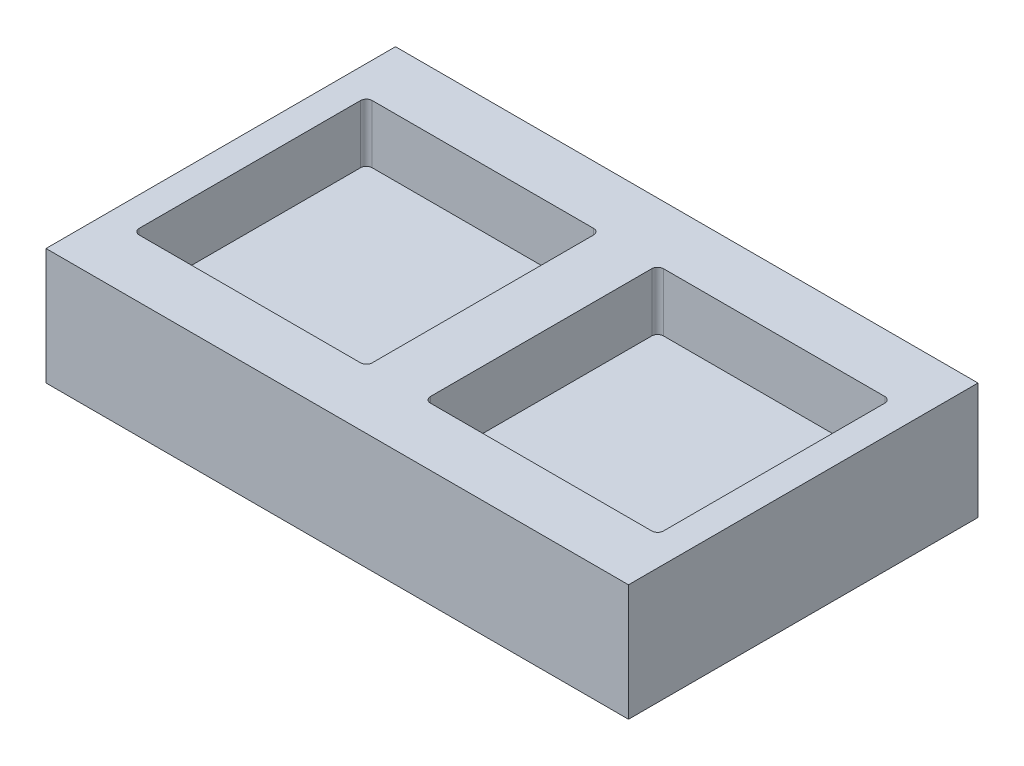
ISO-10303-21;
HEADER;
FILE_DESCRIPTION(('STEP AP214'),'2;1');
FILE_NAME('part.step','',(''),(''),'','','');
FILE_SCHEMA(('AUTOMOTIVE_DESIGN { 1 0 10303 214 1 1 1 1 }'));
ENDSEC;
DATA;
#1=APPLICATION_CONTEXT('core data for automotive mechanical design processes');
#2=APPLICATION_PROTOCOL_DEFINITION('international standard','automotive_design',2000,#1);
#3=PRODUCT_CONTEXT('',#1,'mechanical');
#4=PRODUCT('Part','Part','',(#3));
#5=PRODUCT_RELATED_PRODUCT_CATEGORY('part','',(#4));
#6=PRODUCT_DEFINITION_FORMATION('','',#4);
#7=PRODUCT_DEFINITION_CONTEXT('part definition',#1,'design');
#8=PRODUCT_DEFINITION('design','',#6,#7);
#9=PRODUCT_DEFINITION_SHAPE('','',#8);
#10=(LENGTH_UNIT() NAMED_UNIT(*) SI_UNIT(.MILLI.,.METRE.));
#11=(NAMED_UNIT(*) PLANE_ANGLE_UNIT() SI_UNIT($,.RADIAN.));
#12=(NAMED_UNIT(*) SI_UNIT($,.STERADIAN.) SOLID_ANGLE_UNIT());
#13=UNCERTAINTY_MEASURE_WITH_UNIT(LENGTH_MEASURE(1.E-05),#10,'distance_accuracy_value','');
#14=(GEOMETRIC_REPRESENTATION_CONTEXT(3) GLOBAL_UNCERTAINTY_ASSIGNED_CONTEXT((#13)) GLOBAL_UNIT_ASSIGNED_CONTEXT((#10,
#11,#12)) REPRESENTATION_CONTEXT('',''));
#15=CARTESIAN_POINT('',(0.,0.,0.));
#16=DIRECTION('',(0.,0.,1.));
#17=DIRECTION('',(1.,0.,0.));
#18=AXIS2_PLACEMENT_3D('',#15,#16,#17);
#19=CARTESIAN_POINT('',(-63.5,25.4,-38.1));
#20=DIRECTION('',(1.,0.,0.));
#21=DIRECTION('',(0.,0.,-1.));
#22=AXIS2_PLACEMENT_3D('',#19,#20,#21);
#23=PLANE('',#22);
#24=DIRECTION('',(0.,0.,1.));
#25=VECTOR('',#24,1.);
#26=CARTESIAN_POINT('',(-63.5,0.,-38.1));
#27=LINE('',#26,#25);
#28=CARTESIAN_POINT('',(-63.5,0.,-38.1));
#29=VERTEX_POINT('',#28);
#30=CARTESIAN_POINT('',(-63.5,0.,38.1));
#31=VERTEX_POINT('',#30);
#32=EDGE_CURVE('E171',#29,#31,#27,.T.);
#33=ORIENTED_EDGE('',*,*,#32,.T.);
#34=DIRECTION('',(0.,-1.,0.));
#35=VECTOR('',#34,1.);
#36=CARTESIAN_POINT('',(-63.5,25.4,38.1));
#37=LINE('',#36,#35);
#38=CARTESIAN_POINT('',(-63.5,25.4,38.1));
#39=VERTEX_POINT('',#38);
#40=EDGE_CURVE('E178',#39,#31,#37,.T.);
#41=ORIENTED_EDGE('',*,*,#40,.F.);
#42=DIRECTION('',(0.,0.,1.));
#43=VECTOR('',#42,1.);
#44=CARTESIAN_POINT('',(-63.5,25.4,-38.1));
#45=LINE('',#44,#43);
#46=CARTESIAN_POINT('',(-63.5,25.4,-38.1));
#47=VERTEX_POINT('',#46);
#48=EDGE_CURVE('E200',#47,#39,#45,.T.);
#49=ORIENTED_EDGE('',*,*,#48,.F.);
#50=DIRECTION('',(0.,-1.,0.));
#51=VECTOR('',#50,1.);
#52=CARTESIAN_POINT('',(-63.5,25.4,-38.1));
#53=LINE('',#52,#51);
#54=EDGE_CURVE('E189',#47,#29,#53,.T.);
#55=ORIENTED_EDGE('',*,*,#54,.T.);
#56=EDGE_LOOP('',(#33,#41,#49,#55));
#57=FACE_BOUND('',#56,.T.);
#58=ADVANCED_FACE('F31',(#57),#23,.F.);
#59=CARTESIAN_POINT('',(-63.5,25.4,38.1));
#60=DIRECTION('',(0.,0.,-1.));
#61=DIRECTION('',(-1.,0.,0.));
#62=AXIS2_PLACEMENT_3D('',#59,#60,#61);
#63=PLANE('',#62);
#64=DIRECTION('',(1.,0.,0.));
#65=VECTOR('',#64,1.);
#66=CARTESIAN_POINT('',(-63.5,0.,38.1));
#67=LINE('',#66,#65);
#68=CARTESIAN_POINT('',(63.5,0.,38.1));
#69=VERTEX_POINT('',#68);
#70=EDGE_CURVE('E166',#31,#69,#67,.T.);
#71=ORIENTED_EDGE('',*,*,#70,.T.);
#72=DIRECTION('',(0.,-1.,0.));
#73=VECTOR('',#72,1.);
#74=CARTESIAN_POINT('',(63.5,25.4,38.1));
#75=LINE('',#74,#73);
#76=CARTESIAN_POINT('',(63.5,25.4,38.1));
#77=VERTEX_POINT('',#76);
#78=EDGE_CURVE('E185',#77,#69,#75,.T.);
#79=ORIENTED_EDGE('',*,*,#78,.F.);
#80=DIRECTION('',(1.,0.,0.));
#81=VECTOR('',#80,1.);
#82=CARTESIAN_POINT('',(-63.5,25.4,38.1));
#83=LINE('',#82,#81);
#84=EDGE_CURVE('E180',#39,#77,#83,.T.);
#85=ORIENTED_EDGE('',*,*,#84,.F.);
#86=ORIENTED_EDGE('',*,*,#40,.T.);
#87=EDGE_LOOP('',(#71,#79,#85,#86));
#88=FACE_BOUND('',#87,.T.);
#89=ADVANCED_FACE('F179',(#88),#63,.F.);
#90=CARTESIAN_POINT('',(63.5,25.4,-38.1));
#91=DIRECTION('',(-1.,0.,0.));
#92=DIRECTION('',(0.,0.,1.));
#93=AXIS2_PLACEMENT_3D('',#90,#91,#92);
#94=PLANE('',#93);
#95=DIRECTION('',(0.,0.,-1.));
#96=VECTOR('',#95,1.);
#97=CARTESIAN_POINT('',(63.5,0.,-38.1));
#98=LINE('',#97,#96);
#99=CARTESIAN_POINT('',(63.5,0.,-38.1));
#100=VERTEX_POINT('',#99);
#101=EDGE_CURVE('E172',#69,#100,#98,.T.);
#102=ORIENTED_EDGE('',*,*,#101,.T.);
#103=DIRECTION('',(0.,-1.,0.));
#104=VECTOR('',#103,1.);
#105=CARTESIAN_POINT('',(63.5,25.4,-38.1));
#106=LINE('',#105,#104);
#107=CARTESIAN_POINT('',(63.5,25.4,-38.1));
#108=VERTEX_POINT('',#107);
#109=EDGE_CURVE('E208',#108,#100,#106,.T.);
#110=ORIENTED_EDGE('',*,*,#109,.F.);
#111=DIRECTION('',(0.,0.,-1.));
#112=VECTOR('',#111,1.);
#113=CARTESIAN_POINT('',(63.5,25.4,-38.1));
#114=LINE('',#113,#112);
#115=EDGE_CURVE('E203',#77,#108,#114,.T.);
#116=ORIENTED_EDGE('',*,*,#115,.F.);
#117=ORIENTED_EDGE('',*,*,#78,.T.);
#118=EDGE_LOOP('',(#102,#110,#116,#117));
#119=FACE_BOUND('',#118,.T.);
#120=ADVANCED_FACE('F385',(#119),#94,.F.);
#121=CARTESIAN_POINT('',(-63.5,25.4,-38.1));
#122=DIRECTION('',(0.,0.,1.));
#123=DIRECTION('',(1.,0.,0.));
#124=AXIS2_PLACEMENT_3D('',#121,#122,#123);
#125=PLANE('',#124);
#126=DIRECTION('',(-1.,0.,0.));
#127=VECTOR('',#126,1.);
#128=CARTESIAN_POINT('',(-63.5,0.,-38.1));
#129=LINE('',#128,#127);
#130=EDGE_CURVE('E198',#100,#29,#129,.T.);
#131=ORIENTED_EDGE('',*,*,#130,.T.);
#132=ORIENTED_EDGE('',*,*,#54,.F.);
#133=DIRECTION('',(-1.,0.,0.));
#134=VECTOR('',#133,1.);
#135=CARTESIAN_POINT('',(-63.5,25.4,-38.1));
#136=LINE('',#135,#134);
#137=EDGE_CURVE('E205',#108,#47,#136,.T.);
#138=ORIENTED_EDGE('',*,*,#137,.F.);
#139=ORIENTED_EDGE('',*,*,#109,.T.);
#140=EDGE_LOOP('',(#131,#132,#138,#139));
#141=FACE_BOUND('',#140,.T.);
#142=ADVANCED_FACE('F389',(#141),#125,.F.);
#143=CARTESIAN_POINT('',(-63.5,25.4,38.1));
#144=DIRECTION('',(0.,1.,0.));
#145=DIRECTION('',(0.,0.,1.));
#146=AXIS2_PLACEMENT_3D('',#143,#144,#145);
#147=PLANE('',#146);
#148=DIRECTION('',(-1.,0.,0.));
#149=VECTOR('',#148,1.);
#150=CARTESIAN_POINT('',(-57.15,25.4,-25.4));
#151=LINE('',#150,#149);
#152=CARTESIAN_POINT('',(-7.62000000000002,25.4,-25.4));
#153=VERTEX_POINT('',#152);
#154=CARTESIAN_POINT('',(-55.88,25.4,-25.4));
#155=VERTEX_POINT('',#154);
#156=EDGE_CURVE('E284',#153,#155,#151,.T.);
#157=ORIENTED_EDGE('',*,*,#156,.F.);
#158=CARTESIAN_POINT('',(-7.62000000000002,25.4,-24.13));
#159=DIRECTION('',(0.,1.,0.));
#160=DIRECTION('',(0.,0.,1.));
#161=AXIS2_PLACEMENT_3D('',#158,#159,#160);
#162=CIRCLE('',#161,1.27);
#163=CARTESIAN_POINT('',(-6.35000000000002,25.4,-24.13));
#164=VERTEX_POINT('',#163);
#165=EDGE_CURVE('E276',#153,#164,#162,.F.);
#166=ORIENTED_EDGE('',*,*,#165,.T.);
#167=DIRECTION('',(0.,0.,-1.));
#168=VECTOR('',#167,1.);
#169=CARTESIAN_POINT('',(-6.35000000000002,25.4,-25.4));
#170=LINE('',#169,#168);
#171=CARTESIAN_POINT('',(-6.35000000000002,25.4,24.13));
#172=VERTEX_POINT('',#171);
#173=EDGE_CURVE('E282',#172,#164,#170,.T.);
#174=ORIENTED_EDGE('',*,*,#173,.F.);
#175=CARTESIAN_POINT('',(-7.62000000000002,25.4,24.13));
#176=DIRECTION('',(0.,1.,0.));
#177=DIRECTION('',(0.,0.,1.));
#178=AXIS2_PLACEMENT_3D('',#175,#176,#177);
#179=CIRCLE('',#178,1.27);
#180=CARTESIAN_POINT('',(-7.62000000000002,25.4,25.4));
#181=VERTEX_POINT('',#180);
#182=EDGE_CURVE('E266',#172,#181,#179,.F.);
#183=ORIENTED_EDGE('',*,*,#182,.T.);
#184=DIRECTION('',(1.,0.,0.));
#185=VECTOR('',#184,1.);
#186=CARTESIAN_POINT('',(-6.35000000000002,25.4,25.4));
#187=LINE('',#186,#185);
#188=CARTESIAN_POINT('',(-55.88,25.4,25.4));
#189=VERTEX_POINT('',#188);
#190=EDGE_CURVE('E294',#189,#181,#187,.T.);
#191=ORIENTED_EDGE('',*,*,#190,.F.);
#192=CARTESIAN_POINT('',(-55.88,25.4,24.13));
#193=DIRECTION('',(0.,1.,0.));
#194=DIRECTION('',(0.,0.,1.));
#195=AXIS2_PLACEMENT_3D('',#192,#193,#194);
#196=CIRCLE('',#195,1.27);
#197=CARTESIAN_POINT('',(-57.15,25.4,24.13));
#198=VERTEX_POINT('',#197);
#199=EDGE_CURVE('E38',#189,#198,#196,.F.);
#200=ORIENTED_EDGE('',*,*,#199,.T.);
#201=DIRECTION('',(0.,0.,1.));
#202=VECTOR('',#201,1.);
#203=CARTESIAN_POINT('',(-57.15,25.4,25.4));
#204=LINE('',#203,#202);
#205=CARTESIAN_POINT('',(-57.15,25.4,-24.13));
#206=VERTEX_POINT('',#205);
#207=EDGE_CURVE('E514',#206,#198,#204,.T.);
#208=ORIENTED_EDGE('',*,*,#207,.F.);
#209=CARTESIAN_POINT('',(-55.88,25.4,-24.13));
#210=DIRECTION('',(0.,1.,0.));
#211=DIRECTION('',(0.,0.,1.));
#212=AXIS2_PLACEMENT_3D('',#209,#210,#211);
#213=CIRCLE('',#212,1.27);
#214=EDGE_CURVE('E11',#206,#155,#213,.F.);
#215=ORIENTED_EDGE('',*,*,#214,.T.);
#216=EDGE_LOOP('',(#157,#166,#174,#183,#191,#200,#208,#215));
#217=FACE_BOUND('',#216,.T.);
#218=DIRECTION('',(-1.,0.,0.));
#219=VECTOR('',#218,1.);
#220=CARTESIAN_POINT('',(6.35,25.4,-25.4));
#221=LINE('',#220,#219);
#222=CARTESIAN_POINT('',(55.88,25.4,-25.4));
#223=VERTEX_POINT('',#222);
#224=CARTESIAN_POINT('',(7.61999999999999,25.4,-25.4));
#225=VERTEX_POINT('',#224);
#226=EDGE_CURVE('E316',#223,#225,#221,.T.);
#227=ORIENTED_EDGE('',*,*,#226,.F.);
#228=CARTESIAN_POINT('',(55.88,25.4,-24.13));
#229=DIRECTION('',(0.,1.,0.));
#230=DIRECTION('',(0.,0.,1.));
#231=AXIS2_PLACEMENT_3D('',#228,#229,#230);
#232=CIRCLE('',#231,1.27);
#233=CARTESIAN_POINT('',(57.15,25.4,-24.13));
#234=VERTEX_POINT('',#233);
#235=EDGE_CURVE('E270',#223,#234,#232,.F.);
#236=ORIENTED_EDGE('',*,*,#235,.T.);
#237=DIRECTION('',(0.,0.,-1.));
#238=VECTOR('',#237,1.);
#239=CARTESIAN_POINT('',(57.15,25.4,-25.4));
#240=LINE('',#239,#238);
#241=CARTESIAN_POINT('',(57.15,25.4,24.13));
#242=VERTEX_POINT('',#241);
#243=EDGE_CURVE('E325',#242,#234,#240,.T.);
#244=ORIENTED_EDGE('',*,*,#243,.F.);
#245=CARTESIAN_POINT('',(55.88,25.4,24.13));
#246=DIRECTION('',(0.,1.,0.));
#247=DIRECTION('',(0.,0.,1.));
#248=AXIS2_PLACEMENT_3D('',#245,#246,#247);
#249=CIRCLE('',#248,1.27);
#250=CARTESIAN_POINT('',(55.88,25.4,25.4));
#251=VERTEX_POINT('',#250);
#252=EDGE_CURVE('E272',#242,#251,#249,.F.);
#253=ORIENTED_EDGE('',*,*,#252,.T.);
#254=DIRECTION('',(1.,0.,0.));
#255=VECTOR('',#254,1.);
#256=CARTESIAN_POINT('',(57.15,25.4,25.4));
#257=LINE('',#256,#255);
#258=CARTESIAN_POINT('',(7.62,25.4,25.4));
#259=VERTEX_POINT('',#258);
#260=EDGE_CURVE('E322',#259,#251,#257,.T.);
#261=ORIENTED_EDGE('',*,*,#260,.F.);
#262=CARTESIAN_POINT('',(7.62,25.4,24.13));
#263=DIRECTION('',(0.,1.,0.));
#264=DIRECTION('',(0.,0.,1.));
#265=AXIS2_PLACEMENT_3D('',#262,#263,#264);
#266=CIRCLE('',#265,1.27);
#267=CARTESIAN_POINT('',(6.35,25.4,24.13));
#268=VERTEX_POINT('',#267);
#269=EDGE_CURVE('E274',#259,#268,#266,.F.);
#270=ORIENTED_EDGE('',*,*,#269,.T.);
#271=DIRECTION('',(0.,0.,1.));
#272=VECTOR('',#271,1.);
#273=CARTESIAN_POINT('',(6.35,25.4,25.4));
#274=LINE('',#273,#272);
#275=CARTESIAN_POINT('',(6.35,25.4,-24.13));
#276=VERTEX_POINT('',#275);
#277=EDGE_CURVE('E319',#276,#268,#274,.T.);
#278=ORIENTED_EDGE('',*,*,#277,.F.);
#279=CARTESIAN_POINT('',(7.62,25.4,-24.13));
#280=DIRECTION('',(0.,1.,0.));
#281=DIRECTION('',(0.,0.,1.));
#282=AXIS2_PLACEMENT_3D('',#279,#280,#281);
#283=CIRCLE('',#282,1.27);
#284=EDGE_CURVE('E268',#276,#225,#283,.F.);
#285=ORIENTED_EDGE('',*,*,#284,.T.);
#286=EDGE_LOOP('',(#227,#236,#244,#253,#261,#270,#278,#285));
#287=FACE_BOUND('',#286,.T.);
#288=ORIENTED_EDGE('',*,*,#48,.T.);
#289=ORIENTED_EDGE('',*,*,#84,.T.);
#290=ORIENTED_EDGE('',*,*,#115,.T.);
#291=ORIENTED_EDGE('',*,*,#137,.T.);
#292=EDGE_LOOP('',(#288,#289,#290,#291));
#293=FACE_BOUND('',#292,.T.);
#294=ADVANCED_FACE('F280',(#217,#287,#293),#147,.T.);
#295=CARTESIAN_POINT('',(-63.5,0.,38.1));
#296=DIRECTION('',(0.,1.,0.));
#297=DIRECTION('',(0.,0.,1.));
#298=AXIS2_PLACEMENT_3D('',#295,#296,#297);
#299=PLANE('',#298);
#300=ORIENTED_EDGE('',*,*,#32,.F.);
#301=ORIENTED_EDGE('',*,*,#130,.F.);
#302=ORIENTED_EDGE('',*,*,#101,.F.);
#303=ORIENTED_EDGE('',*,*,#70,.F.);
#304=EDGE_LOOP('',(#300,#301,#302,#303));
#305=FACE_BOUND('',#304,.T.);
#306=ADVANCED_FACE('F168',(#305),#299,.F.);
#307=CARTESIAN_POINT('',(6.35,12.7,-25.4));
#308=DIRECTION('',(0.,0.,-1.));
#309=DIRECTION('',(-1.,0.,0.));
#310=AXIS2_PLACEMENT_3D('',#307,#308,#309);
#311=PLANE('',#310);
#312=ORIENTED_EDGE('',*,*,#226,.T.);
#313=DIRECTION('',(0.,1.,0.));
#314=VECTOR('',#313,1.);
#315=CARTESIAN_POINT('',(7.62,12.7,-25.4));
#316=LINE('',#315,#314);
#317=CARTESIAN_POINT('',(7.61999999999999,12.7,-25.4));
#318=VERTEX_POINT('',#317);
#319=EDGE_CURVE('E237',#225,#318,#316,.F.);
#320=ORIENTED_EDGE('',*,*,#319,.T.);
#321=DIRECTION('',(-1.,0.,0.));
#322=VECTOR('',#321,1.);
#323=CARTESIAN_POINT('',(6.35,12.7,-25.4));
#324=LINE('',#323,#322);
#325=CARTESIAN_POINT('',(55.88,12.7,-25.4));
#326=VERTEX_POINT('',#325);
#327=EDGE_CURVE('E328',#326,#318,#324,.T.);
#328=ORIENTED_EDGE('',*,*,#327,.F.);
#329=DIRECTION('',(0.,1.,0.));
#330=VECTOR('',#329,1.);
#331=CARTESIAN_POINT('',(55.88,25.4,-25.4));
#332=LINE('',#331,#330);
#333=EDGE_CURVE('E234',#326,#223,#332,.T.);
#334=ORIENTED_EDGE('',*,*,#333,.T.);
#335=EDGE_LOOP('',(#312,#320,#328,#334));
#336=FACE_BOUND('',#335,.T.);
#337=ADVANCED_FACE('F359',(#336),#311,.F.);
#338=CARTESIAN_POINT('',(57.15,12.7,-25.4));
#339=DIRECTION('',(1.,0.,0.));
#340=DIRECTION('',(0.,0.,-1.));
#341=AXIS2_PLACEMENT_3D('',#338,#339,#340);
#342=PLANE('',#341);
#343=ORIENTED_EDGE('',*,*,#243,.T.);
#344=DIRECTION('',(0.,1.,0.));
#345=VECTOR('',#344,1.);
#346=CARTESIAN_POINT('',(57.15,12.7,-24.13));
#347=LINE('',#346,#345);
#348=CARTESIAN_POINT('',(57.15,12.7,-24.13));
#349=VERTEX_POINT('',#348);
#350=EDGE_CURVE('E250',#234,#349,#347,.F.);
#351=ORIENTED_EDGE('',*,*,#350,.T.);
#352=DIRECTION('',(0.,0.,-1.));
#353=VECTOR('',#352,1.);
#354=CARTESIAN_POINT('',(57.15,12.7,-25.4));
#355=LINE('',#354,#353);
#356=CARTESIAN_POINT('',(57.15,12.7,24.13));
#357=VERTEX_POINT('',#356);
#358=EDGE_CURVE('E190',#357,#349,#355,.T.);
#359=ORIENTED_EDGE('',*,*,#358,.F.);
#360=DIRECTION('',(0.,1.,0.));
#361=VECTOR('',#360,1.);
#362=CARTESIAN_POINT('',(57.15,25.4,24.13));
#363=LINE('',#362,#361);
#364=EDGE_CURVE('E247',#357,#242,#363,.T.);
#365=ORIENTED_EDGE('',*,*,#364,.T.);
#366=EDGE_LOOP('',(#343,#351,#359,#365));
#367=FACE_BOUND('',#366,.T.);
#368=ADVANCED_FACE('F348',(#367),#342,.F.);
#369=CARTESIAN_POINT('',(57.15,12.7,25.4));
#370=DIRECTION('',(0.,0.,1.));
#371=DIRECTION('',(1.,0.,0.));
#372=AXIS2_PLACEMENT_3D('',#369,#370,#371);
#373=PLANE('',#372);
#374=ORIENTED_EDGE('',*,*,#260,.T.);
#375=DIRECTION('',(0.,1.,0.));
#376=VECTOR('',#375,1.);
#377=CARTESIAN_POINT('',(55.88,12.7,25.4));
#378=LINE('',#377,#376);
#379=CARTESIAN_POINT('',(55.88,12.7,25.4));
#380=VERTEX_POINT('',#379);
#381=EDGE_CURVE('E255',#251,#380,#378,.F.);
#382=ORIENTED_EDGE('',*,*,#381,.T.);
#383=DIRECTION('',(1.,0.,0.));
#384=VECTOR('',#383,1.);
#385=CARTESIAN_POINT('',(57.15,12.7,25.4));
#386=LINE('',#385,#384);
#387=CARTESIAN_POINT('',(7.62,12.7,25.4));
#388=VERTEX_POINT('',#387);
#389=EDGE_CURVE('E193',#388,#380,#386,.T.);
#390=ORIENTED_EDGE('',*,*,#389,.F.);
#391=DIRECTION('',(0.,1.,0.));
#392=VECTOR('',#391,1.);
#393=CARTESIAN_POINT('',(7.62,25.4,25.4));
#394=LINE('',#393,#392);
#395=EDGE_CURVE('E252',#388,#259,#394,.T.);
#396=ORIENTED_EDGE('',*,*,#395,.T.);
#397=EDGE_LOOP('',(#374,#382,#390,#396));
#398=FACE_BOUND('',#397,.T.);
#399=ADVANCED_FACE('F372',(#398),#373,.F.);
#400=CARTESIAN_POINT('',(6.35,12.7,25.4));
#401=DIRECTION('',(-1.,0.,0.));
#402=DIRECTION('',(0.,0.,1.));
#403=AXIS2_PLACEMENT_3D('',#400,#401,#402);
#404=PLANE('',#403);
#405=DIRECTION('',(0.,0.,1.));
#406=VECTOR('',#405,1.);
#407=CARTESIAN_POINT('',(6.35,12.7,25.4));
#408=LINE('',#407,#406);
#409=CARTESIAN_POINT('',(6.35,12.7,-24.13));
#410=VERTEX_POINT('',#409);
#411=CARTESIAN_POINT('',(6.35,12.7,24.13));
#412=VERTEX_POINT('',#411);
#413=EDGE_CURVE('E331',#410,#412,#408,.T.);
#414=ORIENTED_EDGE('',*,*,#413,.F.);
#415=DIRECTION('',(0.,1.,0.));
#416=VECTOR('',#415,1.);
#417=CARTESIAN_POINT('',(6.35,25.4,-24.13));
#418=LINE('',#417,#416);
#419=EDGE_CURVE('E231',#410,#276,#418,.T.);
#420=ORIENTED_EDGE('',*,*,#419,.T.);
#421=ORIENTED_EDGE('',*,*,#277,.T.);
#422=DIRECTION('',(0.,1.,0.));
#423=VECTOR('',#422,1.);
#424=CARTESIAN_POINT('',(6.35,12.7,24.13));
#425=LINE('',#424,#423);
#426=EDGE_CURVE('E229',#268,#412,#425,.F.);
#427=ORIENTED_EDGE('',*,*,#426,.T.);
#428=EDGE_LOOP('',(#414,#420,#421,#427));
#429=FACE_BOUND('',#428,.T.);
#430=ADVANCED_FACE('F368',(#429),#404,.F.);
#431=CARTESIAN_POINT('',(6.35,12.7,-25.4));
#432=DIRECTION('',(0.,1.,0.));
#433=DIRECTION('',(0.,0.,1.));
#434=AXIS2_PLACEMENT_3D('',#431,#432,#433);
#435=PLANE('',#434);
#436=ORIENTED_EDGE('',*,*,#327,.T.);
#437=CARTESIAN_POINT('',(7.62,12.7,-24.13));
#438=DIRECTION('',(0.,1.,0.));
#439=DIRECTION('',(0.,0.,1.));
#440=AXIS2_PLACEMENT_3D('',#437,#438,#439);
#441=CIRCLE('',#440,1.27);
#442=EDGE_CURVE('E245',#318,#410,#441,.T.);
#443=ORIENTED_EDGE('',*,*,#442,.T.);
#444=ORIENTED_EDGE('',*,*,#413,.T.);
#445=CARTESIAN_POINT('',(7.62,12.7,24.13));
#446=DIRECTION('',(0.,1.,0.));
#447=DIRECTION('',(0.,0.,1.));
#448=AXIS2_PLACEMENT_3D('',#445,#446,#447);
#449=CIRCLE('',#448,1.27);
#450=EDGE_CURVE('E239',#412,#388,#449,.T.);
#451=ORIENTED_EDGE('',*,*,#450,.T.);
#452=ORIENTED_EDGE('',*,*,#389,.T.);
#453=CARTESIAN_POINT('',(55.88,12.7,24.13));
#454=DIRECTION('',(0.,1.,0.));
#455=DIRECTION('',(0.,0.,1.));
#456=AXIS2_PLACEMENT_3D('',#453,#454,#455);
#457=CIRCLE('',#456,1.27);
#458=EDGE_CURVE('E241',#380,#357,#457,.T.);
#459=ORIENTED_EDGE('',*,*,#458,.T.);
#460=ORIENTED_EDGE('',*,*,#358,.T.);
#461=CARTESIAN_POINT('',(55.88,12.7,-24.13));
#462=DIRECTION('',(0.,1.,0.));
#463=DIRECTION('',(0.,0.,1.));
#464=AXIS2_PLACEMENT_3D('',#461,#462,#463);
#465=CIRCLE('',#464,1.27);
#466=EDGE_CURVE('E243',#349,#326,#465,.T.);
#467=ORIENTED_EDGE('',*,*,#466,.T.);
#468=EDGE_LOOP('',(#436,#443,#444,#451,#452,#459,#460,#467));
#469=FACE_BOUND('',#468,.T.);
#470=ADVANCED_FACE('F337',(#469),#435,.T.);
#471=CARTESIAN_POINT('',(-57.15,12.7,-25.4));
#472=DIRECTION('',(0.,0.,-1.));
#473=DIRECTION('',(-1.,0.,0.));
#474=AXIS2_PLACEMENT_3D('',#471,#472,#473);
#475=PLANE('',#474);
#476=DIRECTION('',(-1.,0.,0.));
#477=VECTOR('',#476,1.);
#478=CARTESIAN_POINT('',(-57.15,12.7,-25.4));
#479=LINE('',#478,#477);
#480=CARTESIAN_POINT('',(-7.62000000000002,12.7,-25.4));
#481=VERTEX_POINT('',#480);
#482=CARTESIAN_POINT('',(-55.88,12.7,-25.4));
#483=VERTEX_POINT('',#482);
#484=EDGE_CURVE('E293',#481,#483,#479,.T.);
#485=ORIENTED_EDGE('',*,*,#484,.F.);
#486=DIRECTION('',(0.,1.,0.));
#487=VECTOR('',#486,1.);
#488=CARTESIAN_POINT('',(-7.62000000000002,25.4,-25.4));
#489=LINE('',#488,#487);
#490=EDGE_CURVE('E259',#481,#153,#489,.T.);
#491=ORIENTED_EDGE('',*,*,#490,.T.);
#492=ORIENTED_EDGE('',*,*,#156,.T.);
#493=DIRECTION('',(0.,1.,0.));
#494=VECTOR('',#493,1.);
#495=CARTESIAN_POINT('',(-55.88,12.7,-25.4));
#496=LINE('',#495,#494);
#497=EDGE_CURVE('E257',#155,#483,#496,.F.);
#498=ORIENTED_EDGE('',*,*,#497,.T.);
#499=EDGE_LOOP('',(#485,#491,#492,#498));
#500=FACE_BOUND('',#499,.T.);
#501=ADVANCED_FACE('F306',(#500),#475,.F.);
#502=CARTESIAN_POINT('',(-6.35000000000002,12.7,-25.4));
#503=DIRECTION('',(1.,0.,0.));
#504=DIRECTION('',(0.,0.,-1.));
#505=AXIS2_PLACEMENT_3D('',#502,#503,#504);
#506=PLANE('',#505);
#507=DIRECTION('',(0.,0.,-1.));
#508=VECTOR('',#507,1.);
#509=CARTESIAN_POINT('',(-6.35000000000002,12.7,-25.4));
#510=LINE('',#509,#508);
#511=CARTESIAN_POINT('',(-6.35000000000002,12.7,24.13));
#512=VERTEX_POINT('',#511);
#513=CARTESIAN_POINT('',(-6.35000000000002,12.7,-24.13));
#514=VERTEX_POINT('',#513);
#515=EDGE_CURVE('E304',#512,#514,#510,.T.);
#516=ORIENTED_EDGE('',*,*,#515,.F.);
#517=DIRECTION('',(0.,1.,0.));
#518=VECTOR('',#517,1.);
#519=CARTESIAN_POINT('',(-6.35000000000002,25.4,24.13));
#520=LINE('',#519,#518);
#521=EDGE_CURVE('E213',#512,#172,#520,.T.);
#522=ORIENTED_EDGE('',*,*,#521,.T.);
#523=ORIENTED_EDGE('',*,*,#173,.T.);
#524=DIRECTION('',(0.,1.,0.));
#525=VECTOR('',#524,1.);
#526=CARTESIAN_POINT('',(-6.35000000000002,12.7,-24.13));
#527=LINE('',#526,#525);
#528=EDGE_CURVE('E184',#164,#514,#527,.F.);
#529=ORIENTED_EDGE('',*,*,#528,.T.);
#530=EDGE_LOOP('',(#516,#522,#523,#529));
#531=FACE_BOUND('',#530,.T.);
#532=ADVANCED_FACE('F290',(#531),#506,.F.);
#533=CARTESIAN_POINT('',(-6.35000000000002,12.7,25.4));
#534=DIRECTION('',(0.,0.,1.));
#535=DIRECTION('',(1.,0.,0.));
#536=AXIS2_PLACEMENT_3D('',#533,#534,#535);
#537=PLANE('',#536);
#538=ORIENTED_EDGE('',*,*,#190,.T.);
#539=DIRECTION('',(0.,1.,0.));
#540=VECTOR('',#539,1.);
#541=CARTESIAN_POINT('',(-7.62000000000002,12.7,25.4));
#542=LINE('',#541,#540);
#543=CARTESIAN_POINT('',(-7.62000000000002,12.7,25.4));
#544=VERTEX_POINT('',#543);
#545=EDGE_CURVE('E219',#181,#544,#542,.F.);
#546=ORIENTED_EDGE('',*,*,#545,.T.);
#547=DIRECTION('',(1.,0.,0.));
#548=VECTOR('',#547,1.);
#549=CARTESIAN_POINT('',(-6.35000000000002,12.7,25.4));
#550=LINE('',#549,#548);
#551=CARTESIAN_POINT('',(-55.88,12.7,25.4));
#552=VERTEX_POINT('',#551);
#553=EDGE_CURVE('E310',#552,#544,#550,.T.);
#554=ORIENTED_EDGE('',*,*,#553,.F.);
#555=DIRECTION('',(0.,1.,0.));
#556=VECTOR('',#555,1.);
#557=CARTESIAN_POINT('',(-55.88,25.4,25.4));
#558=LINE('',#557,#556);
#559=EDGE_CURVE('E216',#552,#189,#558,.T.);
#560=ORIENTED_EDGE('',*,*,#559,.T.);
#561=EDGE_LOOP('',(#538,#546,#554,#560));
#562=FACE_BOUND('',#561,.T.);
#563=ADVANCED_FACE('F435',(#562),#537,.F.);
#564=CARTESIAN_POINT('',(-57.15,12.7,25.4));
#565=DIRECTION('',(-1.,0.,0.));
#566=DIRECTION('',(0.,0.,1.));
#567=AXIS2_PLACEMENT_3D('',#564,#565,#566);
#568=PLANE('',#567);
#569=ORIENTED_EDGE('',*,*,#207,.T.);
#570=DIRECTION('',(0.,1.,0.));
#571=VECTOR('',#570,1.);
#572=CARTESIAN_POINT('',(-57.15,12.7,24.13));
#573=LINE('',#572,#571);
#574=CARTESIAN_POINT('',(-57.15,12.7,24.13));
#575=VERTEX_POINT('',#574);
#576=EDGE_CURVE('E264',#198,#575,#573,.F.);
#577=ORIENTED_EDGE('',*,*,#576,.T.);
#578=DIRECTION('',(0.,0.,1.));
#579=VECTOR('',#578,1.);
#580=CARTESIAN_POINT('',(-57.15,12.7,25.4));
#581=LINE('',#580,#579);
#582=CARTESIAN_POINT('',(-57.15,12.7,-24.13));
#583=VERTEX_POINT('',#582);
#584=EDGE_CURVE('E307',#583,#575,#581,.T.);
#585=ORIENTED_EDGE('',*,*,#584,.F.);
#586=DIRECTION('',(0.,1.,0.));
#587=VECTOR('',#586,1.);
#588=CARTESIAN_POINT('',(-57.15,25.4,-24.13));
#589=LINE('',#588,#587);
#590=EDGE_CURVE('E262',#583,#206,#589,.T.);
#591=ORIENTED_EDGE('',*,*,#590,.T.);
#592=EDGE_LOOP('',(#569,#577,#585,#591));
#593=FACE_BOUND('',#592,.T.);
#594=ADVANCED_FACE('F442',(#593),#568,.F.);
#595=CARTESIAN_POINT('',(-57.15,12.7,-25.4));
#596=DIRECTION('',(0.,1.,0.));
#597=DIRECTION('',(0.,0.,1.));
#598=AXIS2_PLACEMENT_3D('',#595,#596,#597);
#599=PLANE('',#598);
#600=ORIENTED_EDGE('',*,*,#553,.T.);
#601=CARTESIAN_POINT('',(-7.62000000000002,12.7,24.13));
#602=DIRECTION('',(0.,1.,0.));
#603=DIRECTION('',(0.,0.,1.));
#604=AXIS2_PLACEMENT_3D('',#601,#602,#603);
#605=CIRCLE('',#604,1.27);
#606=EDGE_CURVE('E227',#544,#512,#605,.T.);
#607=ORIENTED_EDGE('',*,*,#606,.T.);
#608=ORIENTED_EDGE('',*,*,#515,.T.);
#609=CARTESIAN_POINT('',(-7.62000000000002,12.7,-24.13));
#610=DIRECTION('',(0.,1.,0.));
#611=DIRECTION('',(0.,0.,1.));
#612=AXIS2_PLACEMENT_3D('',#609,#610,#611);
#613=CIRCLE('',#612,1.27);
#614=EDGE_CURVE('E225',#514,#481,#613,.T.);
#615=ORIENTED_EDGE('',*,*,#614,.T.);
#616=ORIENTED_EDGE('',*,*,#484,.T.);
#617=CARTESIAN_POINT('',(-55.88,12.7,-24.13));
#618=DIRECTION('',(0.,1.,0.));
#619=DIRECTION('',(0.,0.,1.));
#620=AXIS2_PLACEMENT_3D('',#617,#618,#619);
#621=CIRCLE('',#620,1.27);
#622=EDGE_CURVE('E221',#483,#583,#621,.T.);
#623=ORIENTED_EDGE('',*,*,#622,.T.);
#624=ORIENTED_EDGE('',*,*,#584,.T.);
#625=CARTESIAN_POINT('',(-55.88,12.7,24.13));
#626=DIRECTION('',(0.,1.,0.));
#627=DIRECTION('',(0.,0.,1.));
#628=AXIS2_PLACEMENT_3D('',#625,#626,#627);
#629=CIRCLE('',#628,1.27);
#630=EDGE_CURVE('E223',#575,#552,#629,.T.);
#631=ORIENTED_EDGE('',*,*,#630,.T.);
#632=EDGE_LOOP('',(#600,#607,#608,#615,#616,#623,#624,#631));
#633=FACE_BOUND('',#632,.T.);
#634=ADVANCED_FACE('F302',(#633),#599,.T.);
#635=CARTESIAN_POINT('',(-7.62000000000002,12.7,24.13));
#636=DIRECTION('',(0.,-1.,0.));
#637=DIRECTION('',(0.,0.,-1.));
#638=AXIS2_PLACEMENT_3D('',#635,#636,#637);
#639=CYLINDRICAL_SURFACE('',#638,1.27);
#640=ORIENTED_EDGE('',*,*,#606,.F.);
#641=ORIENTED_EDGE('',*,*,#545,.F.);
#642=ORIENTED_EDGE('',*,*,#182,.F.);
#643=ORIENTED_EDGE('',*,*,#521,.F.);
#644=EDGE_LOOP('',(#640,#641,#642,#643));
#645=FACE_BOUND('',#644,.T.);
#646=ADVANCED_FACE('F457',(#645),#639,.F.);
#647=CARTESIAN_POINT('',(7.62,12.7,-24.13));
#648=DIRECTION('',(0.,-1.,0.));
#649=DIRECTION('',(0.,0.,-1.));
#650=AXIS2_PLACEMENT_3D('',#647,#648,#649);
#651=CYLINDRICAL_SURFACE('',#650,1.27);
#652=ORIENTED_EDGE('',*,*,#442,.F.);
#653=ORIENTED_EDGE('',*,*,#319,.F.);
#654=ORIENTED_EDGE('',*,*,#284,.F.);
#655=ORIENTED_EDGE('',*,*,#419,.F.);
#656=EDGE_LOOP('',(#652,#653,#654,#655));
#657=FACE_BOUND('',#656,.T.);
#658=ADVANCED_FACE('F365',(#657),#651,.F.);
#659=CARTESIAN_POINT('',(55.88,12.7,-24.13));
#660=DIRECTION('',(0.,-1.,0.));
#661=DIRECTION('',(0.,0.,-1.));
#662=AXIS2_PLACEMENT_3D('',#659,#660,#661);
#663=CYLINDRICAL_SURFACE('',#662,1.27);
#664=ORIENTED_EDGE('',*,*,#466,.F.);
#665=ORIENTED_EDGE('',*,*,#350,.F.);
#666=ORIENTED_EDGE('',*,*,#235,.F.);
#667=ORIENTED_EDGE('',*,*,#333,.F.);
#668=EDGE_LOOP('',(#664,#665,#666,#667));
#669=FACE_BOUND('',#668,.T.);
#670=ADVANCED_FACE('F356',(#669),#663,.F.);
#671=CARTESIAN_POINT('',(55.88,12.7,24.13));
#672=DIRECTION('',(0.,-1.,0.));
#673=DIRECTION('',(0.,0.,-1.));
#674=AXIS2_PLACEMENT_3D('',#671,#672,#673);
#675=CYLINDRICAL_SURFACE('',#674,1.27);
#676=ORIENTED_EDGE('',*,*,#458,.F.);
#677=ORIENTED_EDGE('',*,*,#381,.F.);
#678=ORIENTED_EDGE('',*,*,#252,.F.);
#679=ORIENTED_EDGE('',*,*,#364,.F.);
#680=EDGE_LOOP('',(#676,#677,#678,#679));
#681=FACE_BOUND('',#680,.T.);
#682=ADVANCED_FACE('F345',(#681),#675,.F.);
#683=CARTESIAN_POINT('',(7.62,12.7,24.13));
#684=DIRECTION('',(0.,-1.,0.));
#685=DIRECTION('',(0.,0.,-1.));
#686=AXIS2_PLACEMENT_3D('',#683,#684,#685);
#687=CYLINDRICAL_SURFACE('',#686,1.27);
#688=ORIENTED_EDGE('',*,*,#450,.F.);
#689=ORIENTED_EDGE('',*,*,#426,.F.);
#690=ORIENTED_EDGE('',*,*,#269,.F.);
#691=ORIENTED_EDGE('',*,*,#395,.F.);
#692=EDGE_LOOP('',(#688,#689,#690,#691));
#693=FACE_BOUND('',#692,.T.);
#694=ADVANCED_FACE('F371',(#693),#687,.F.);
#695=CARTESIAN_POINT('',(-7.62000000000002,12.7,-24.13));
#696=DIRECTION('',(0.,-1.,0.));
#697=DIRECTION('',(0.,0.,-1.));
#698=AXIS2_PLACEMENT_3D('',#695,#696,#697);
#699=CYLINDRICAL_SURFACE('',#698,1.27);
#700=ORIENTED_EDGE('',*,*,#614,.F.);
#701=ORIENTED_EDGE('',*,*,#528,.F.);
#702=ORIENTED_EDGE('',*,*,#165,.F.);
#703=ORIENTED_EDGE('',*,*,#490,.F.);
#704=EDGE_LOOP('',(#700,#701,#702,#703));
#705=FACE_BOUND('',#704,.T.);
#706=ADVANCED_FACE('F297',(#705),#699,.F.);
#707=CARTESIAN_POINT('',(-55.88,12.7,24.13));
#708=DIRECTION('',(0.,-1.,0.));
#709=DIRECTION('',(0.,0.,-1.));
#710=AXIS2_PLACEMENT_3D('',#707,#708,#709);
#711=CYLINDRICAL_SURFACE('',#710,1.27);
#712=ORIENTED_EDGE('',*,*,#630,.F.);
#713=ORIENTED_EDGE('',*,*,#576,.F.);
#714=ORIENTED_EDGE('',*,*,#199,.F.);
#715=ORIENTED_EDGE('',*,*,#559,.F.);
#716=EDGE_LOOP('',(#712,#713,#714,#715));
#717=FACE_BOUND('',#716,.T.);
#718=ADVANCED_FACE('F495',(#717),#711,.F.);
#719=CARTESIAN_POINT('',(-55.88,12.7,-24.13));
#720=DIRECTION('',(0.,-1.,0.));
#721=DIRECTION('',(0.,0.,-1.));
#722=AXIS2_PLACEMENT_3D('',#719,#720,#721);
#723=CYLINDRICAL_SURFACE('',#722,1.27);
#724=ORIENTED_EDGE('',*,*,#622,.F.);
#725=ORIENTED_EDGE('',*,*,#497,.F.);
#726=ORIENTED_EDGE('',*,*,#214,.F.);
#727=ORIENTED_EDGE('',*,*,#590,.F.);
#728=EDGE_LOOP('',(#724,#725,#726,#727));
#729=FACE_BOUND('',#728,.T.);
#730=ADVANCED_FACE('F502',(#729),#723,.F.);
#731=CLOSED_SHELL('',(#58,#89,#120,#142,#294,#306,#337,#368,#399,#430,#470,#501,#532,#563,#594,
#634,#646,#658,#670,#682,#694,#706,#718,#730));
#732=MANIFOLD_SOLID_BREP('B2',#731);
#733=ADVANCED_BREP_SHAPE_REPRESENTATION('',(#18,#732),#14);
#734=SHAPE_DEFINITION_REPRESENTATION(#9,#733);
ENDSEC;
END-ISO-10303-21;
